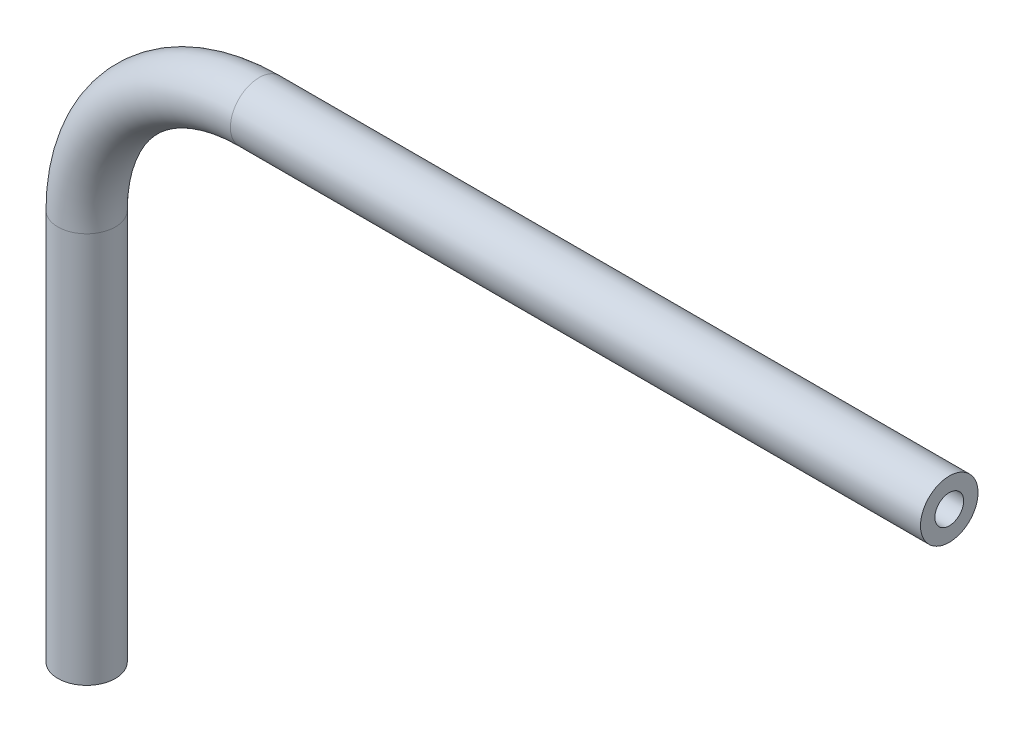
from build123d import *

# Parameters (mm, degrees)
SKETCH2_R   = 1.5875
SKETCH2_R_2 = 0.79375


with BuildPart() as part:
    # Sweep1: sweep along a path in Sketch1
    with BuildLine(Plane.XY) as sweep1_path:
        Line((0, 0), (0, 21.59))
        ThreePointArc((0, 21.59), (2.789807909, 28.325192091), (9.525, 31.115))
        Line((9.525, 31.115), (47.625, 31.115))
    # Sketch2 → Sweep1 (sweep)
    with BuildSketch(Plane(origin=(0, 0, 0), x_dir=(1, 0, 0), z_dir=(0, 1, 0))):
        Circle(SKETCH2_R)
        Circle(SKETCH2_R_2, mode=Mode.SUBTRACT)
    sweep(path=sweep1_path.line)


solid = part.part
